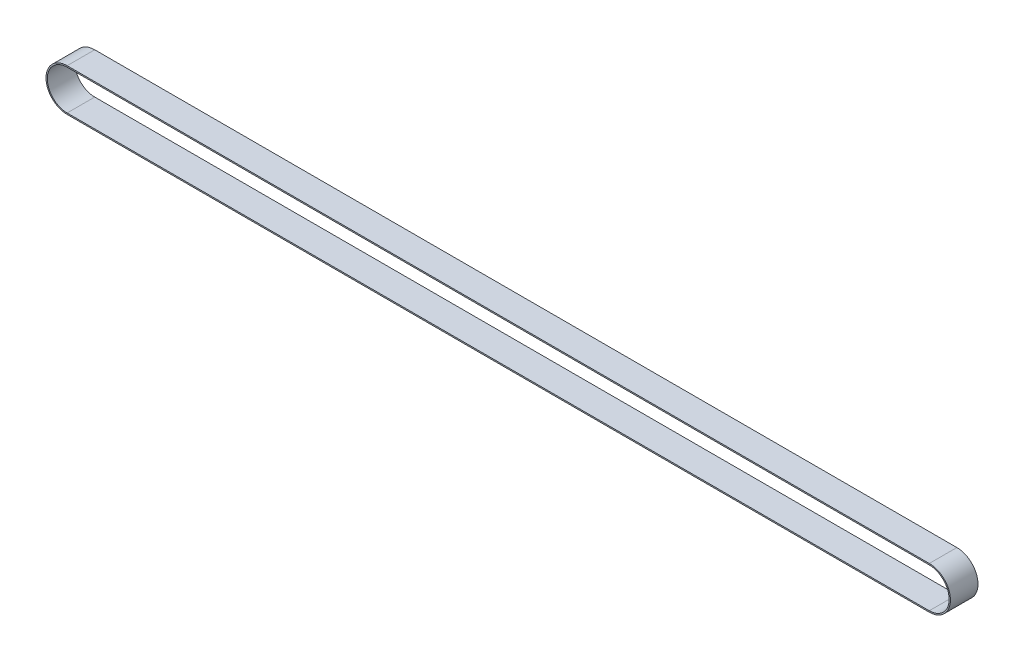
from build123d import *

# Parameters (mm, degrees)
EXTRUDE_THIN1_DEPTH = 16


with BuildPart() as part:
    # Sketch2 → Extrude-Thin1 (new, symmetric)
    with BuildSketch(Plane.XY):
        with BuildLine():
            Line((-51.5, 160.5), (948.5, 160.5))
            ThreePointArc((948.5, 160.5), (973, 136), (948.5, 111.5))
            Line((948.5, 111.5), (-51.5, 111.5))
            ThreePointArc((-51.5, 111.5), (-76, 136), (-51.5, 160.5))
        make_face()
        with BuildLine():
            Line((-51.5, 159), (948.5, 159))
            ThreePointArc((948.5, 159), (971.5, 136), (948.5, 113))
            Line((948.5, 113), (-51.5, 113))
            ThreePointArc((-51.5, 113), (-74.5, 136), (-51.5, 159))
        make_face(mode=Mode.SUBTRACT)
    extrude(amount=EXTRUDE_THIN1_DEPTH, both=True)


solid = part.part
